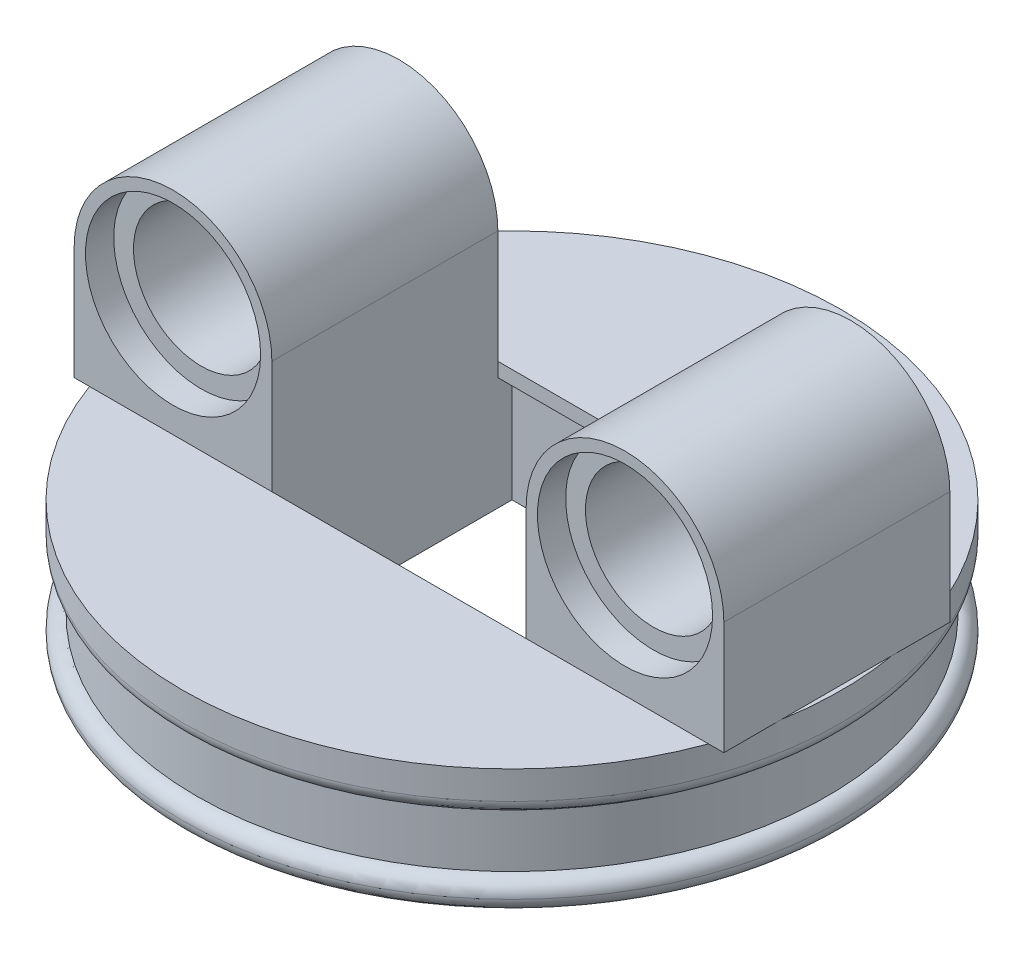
ISO-10303-21;
HEADER;
FILE_DESCRIPTION(('STEP AP214'),'2;1');
FILE_NAME('part.step','',(''),(''),'','','');
FILE_SCHEMA(('AUTOMOTIVE_DESIGN { 1 0 10303 214 1 1 1 1 }'));
ENDSEC;
DATA;
#1=APPLICATION_CONTEXT('core data for automotive mechanical design processes');
#2=APPLICATION_PROTOCOL_DEFINITION('international standard','automotive_design',2000,#1);
#3=PRODUCT_CONTEXT('',#1,'mechanical');
#4=PRODUCT('Part','Part','',(#3));
#5=PRODUCT_RELATED_PRODUCT_CATEGORY('part','',(#4));
#6=PRODUCT_DEFINITION_FORMATION('','',#4);
#7=PRODUCT_DEFINITION_CONTEXT('part definition',#1,'design');
#8=PRODUCT_DEFINITION('design','',#6,#7);
#9=PRODUCT_DEFINITION_SHAPE('','',#8);
#10=(LENGTH_UNIT() NAMED_UNIT(*) SI_UNIT(.MILLI.,.METRE.));
#11=(NAMED_UNIT(*) PLANE_ANGLE_UNIT() SI_UNIT($,.RADIAN.));
#12=(NAMED_UNIT(*) SI_UNIT($,.STERADIAN.) SOLID_ANGLE_UNIT());
#13=UNCERTAINTY_MEASURE_WITH_UNIT(LENGTH_MEASURE(1.E-05),#10,'distance_accuracy_value','');
#14=(GEOMETRIC_REPRESENTATION_CONTEXT(3) GLOBAL_UNCERTAINTY_ASSIGNED_CONTEXT((#13)) GLOBAL_UNIT_ASSIGNED_CONTEXT((#10,
#11,#12)) REPRESENTATION_CONTEXT('',''));
#15=CARTESIAN_POINT('',(0.,0.,0.));
#16=DIRECTION('',(0.,0.,1.));
#17=DIRECTION('',(1.,0.,0.));
#18=AXIS2_PLACEMENT_3D('',#15,#16,#17);
#19=CARTESIAN_POINT('',(0.,-0.5,0.));
#20=DIRECTION('',(0.,1.,0.));
#21=DIRECTION('',(0.,0.,1.));
#22=AXIS2_PLACEMENT_3D('',#19,#20,#21);
#23=PLANE('',#22);
#24=CARTESIAN_POINT('',(0.,-0.5,0.));
#25=DIRECTION('',(0.,-1.,0.));
#26=DIRECTION('',(0.,0.,-1.));
#27=AXIS2_PLACEMENT_3D('',#24,#25,#26);
#28=CIRCLE('',#27,10.665);
#29=CARTESIAN_POINT('',(0.,-0.5,-10.665));
#30=VERTEX_POINT('',#29);
#31=EDGE_CURVE('E284',#30,#30,#28,.T.);
#32=ORIENTED_EDGE('',*,*,#31,.T.);
#33=EDGE_LOOP('',(#32));
#34=FACE_BOUND('',#33,.T.);
#35=DIRECTION('',(-1.,0.,0.));
#36=VECTOR('',#35,1.);
#37=CARTESIAN_POINT('',(5.,-0.5,5.));
#38=LINE('',#37,#36);
#39=CARTESIAN_POINT('',(5.,-0.5,5.));
#40=VERTEX_POINT('',#39);
#41=CARTESIAN_POINT('',(-5.,-0.5,5.));
#42=VERTEX_POINT('',#41);
#43=EDGE_CURVE('E205',#40,#42,#38,.T.);
#44=ORIENTED_EDGE('',*,*,#43,.F.);
#45=DIRECTION('',(0.,0.,1.));
#46=VECTOR('',#45,1.);
#47=CARTESIAN_POINT('',(5.,-0.5,-5.));
#48=LINE('',#47,#46);
#49=CARTESIAN_POINT('',(5.,-0.5,-5.));
#50=VERTEX_POINT('',#49);
#51=EDGE_CURVE('E234',#50,#40,#48,.T.);
#52=ORIENTED_EDGE('',*,*,#51,.F.);
#53=DIRECTION('',(1.,0.,0.));
#54=VECTOR('',#53,1.);
#55=CARTESIAN_POINT('',(-5.,-0.5,-5.));
#56=LINE('',#55,#54);
#57=CARTESIAN_POINT('',(-5.,-0.5,-5.));
#58=VERTEX_POINT('',#57);
#59=EDGE_CURVE('E58',#58,#50,#56,.T.);
#60=ORIENTED_EDGE('',*,*,#59,.F.);
#61=DIRECTION('',(0.,0.,-1.));
#62=VECTOR('',#61,1.);
#63=CARTESIAN_POINT('',(-5.,-0.5,5.));
#64=LINE('',#63,#62);
#65=EDGE_CURVE('E53',#42,#58,#64,.T.);
#66=ORIENTED_EDGE('',*,*,#65,.F.);
#67=EDGE_LOOP('',(#44,#52,#60,#66));
#68=FACE_BOUND('',#67,.T.);
#69=ADVANCED_FACE('F38',(#34,#68),#23,.F.);
#70=DIRECTION('',(1.,0.,0.));
#71=VECTOR('',#70,1.);
#72=CARTESIAN_POINT('',(4.5,-0.5,4.));
#73=LINE('',#72,#71);
#74=CARTESIAN_POINT('',(-4.5,-0.5,4.));
#75=VERTEX_POINT('',#74);
#76=CARTESIAN_POINT('',(4.5,-0.5,4.));
#77=VERTEX_POINT('',#76);
#78=EDGE_CURVE('E261',#75,#77,#73,.T.);
#79=ORIENTED_EDGE('',*,*,#78,.T.);
#80=DIRECTION('',(0.,0.,1.));
#81=VECTOR('',#80,1.);
#82=CARTESIAN_POINT('',(4.5,-0.5,-4.5));
#83=LINE('',#82,#81);
#84=CARTESIAN_POINT('',(4.5,-0.5,4.5));
#85=VERTEX_POINT('',#84);
#86=EDGE_CURVE('E219',#77,#85,#83,.T.);
#87=ORIENTED_EDGE('',*,*,#86,.T.);
#88=DIRECTION('',(-1.,0.,0.));
#89=VECTOR('',#88,1.);
#90=CARTESIAN_POINT('',(-4.5,-0.5,4.5));
#91=LINE('',#90,#89);
#92=CARTESIAN_POINT('',(-4.5,-0.5,4.5));
#93=VERTEX_POINT('',#92);
#94=EDGE_CURVE('E204',#85,#93,#91,.T.);
#95=ORIENTED_EDGE('',*,*,#94,.T.);
#96=DIRECTION('',(0.,0.,-1.));
#97=VECTOR('',#96,1.);
#98=CARTESIAN_POINT('',(-4.5,-0.5,-4.5));
#99=LINE('',#98,#97);
#100=EDGE_CURVE('E222',#93,#75,#99,.T.);
#101=ORIENTED_EDGE('',*,*,#100,.T.);
#102=EDGE_LOOP('',(#79,#87,#95,#101));
#103=FACE_BOUND('',#102,.T.);
#104=ADVANCED_FACE('F418',(#103),#23,.F.);
#105=CARTESIAN_POINT('',(0.,0.,0.));
#106=DIRECTION('',(0.,1.,0.));
#107=DIRECTION('',(0.,0.,1.));
#108=AXIS2_PLACEMENT_3D('',#105,#106,#107);
#109=PLANE('',#108);
#110=DIRECTION('',(-1.,0.,0.));
#111=VECTOR('',#110,1.);
#112=CARTESIAN_POINT('',(-4.5,0.,-4.));
#113=LINE('',#112,#111);
#114=CARTESIAN_POINT('',(4.5,0.,-4.));
#115=VERTEX_POINT('',#114);
#116=CARTESIAN_POINT('',(-4.5,0.,-4.));
#117=VERTEX_POINT('',#116);
#118=EDGE_CURVE('E257',#115,#117,#113,.T.);
#119=ORIENTED_EDGE('',*,*,#118,.F.);
#120=DIRECTION('',(1.,0.,0.));
#121=VECTOR('',#120,1.);
#122=CARTESIAN_POINT('',(4.5,0.,-4.));
#123=LINE('',#122,#121);
#124=CARTESIAN_POINT('',(10.9577472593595,0.,-4.));
#125=VERTEX_POINT('',#124);
#126=EDGE_CURVE('E315',#115,#125,#123,.T.);
#127=ORIENTED_EDGE('',*,*,#126,.T.);
#128=CARTESIAN_POINT('',(0.,0.,0.));
#129=DIRECTION('',(0.,1.,0.));
#130=DIRECTION('',(0.,0.,1.));
#131=AXIS2_PLACEMENT_3D('',#128,#129,#130);
#132=CIRCLE('',#131,11.665);
#133=CARTESIAN_POINT('',(-10.9577472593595,0.,-4.));
#134=VERTEX_POINT('',#133);
#135=EDGE_CURVE('E333',#125,#134,#132,.T.);
#136=ORIENTED_EDGE('',*,*,#135,.T.);
#137=DIRECTION('',(1.,0.,0.));
#138=VECTOR('',#137,1.);
#139=CARTESIAN_POINT('',(-11.5,0.,-4.));
#140=LINE('',#139,#138);
#141=EDGE_CURVE('E377',#134,#117,#140,.T.);
#142=ORIENTED_EDGE('',*,*,#141,.T.);
#143=EDGE_LOOP('',(#119,#127,#136,#142));
#144=FACE_BOUND('',#143,.T.);
#145=ADVANCED_FACE('F425',(#144),#109,.T.);
#146=CARTESIAN_POINT('',(11.5,0.,1.95505115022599));
#147=VERTEX_POINT('',#146);
#148=CARTESIAN_POINT('',(11.5,0.,-1.95505115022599));
#149=VERTEX_POINT('',#148);
#150=EDGE_CURVE('E494',#147,#149,#132,.T.);
#151=ORIENTED_EDGE('',*,*,#150,.T.);
#152=DIRECTION('',(0.,0.,-1.));
#153=VECTOR('',#152,1.);
#154=CARTESIAN_POINT('',(11.5,0.,4.));
#155=LINE('',#154,#153);
#156=EDGE_CURVE('E334',#147,#149,#155,.T.);
#157=ORIENTED_EDGE('',*,*,#156,.F.);
#158=EDGE_LOOP('',(#151,#157));
#159=FACE_BOUND('',#158,.T.);
#160=ADVANCED_FACE('F529',(#159),#109,.T.);
#161=DIRECTION('',(1.,0.,0.));
#162=VECTOR('',#161,1.);
#163=CARTESIAN_POINT('',(4.5,0.,4.));
#164=LINE('',#163,#162);
#165=CARTESIAN_POINT('',(-4.5,0.,4.));
#166=VERTEX_POINT('',#165);
#167=CARTESIAN_POINT('',(4.5,0.,4.));
#168=VERTEX_POINT('',#167);
#169=EDGE_CURVE('E262',#166,#168,#164,.T.);
#170=ORIENTED_EDGE('',*,*,#169,.F.);
#171=DIRECTION('',(1.,0.,0.));
#172=VECTOR('',#171,1.);
#173=CARTESIAN_POINT('',(-11.5,0.,4.));
#174=LINE('',#173,#172);
#175=CARTESIAN_POINT('',(-10.9577472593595,0.,4.));
#176=VERTEX_POINT('',#175);
#177=EDGE_CURVE('E364',#176,#166,#174,.T.);
#178=ORIENTED_EDGE('',*,*,#177,.F.);
#179=CARTESIAN_POINT('',(10.9577472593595,0.,4.));
#180=VERTEX_POINT('',#179);
#181=EDGE_CURVE('E489',#176,#180,#132,.T.);
#182=ORIENTED_EDGE('',*,*,#181,.T.);
#183=DIRECTION('',(1.,0.,0.));
#184=VECTOR('',#183,1.);
#185=CARTESIAN_POINT('',(4.5,0.,4.));
#186=LINE('',#185,#184);
#187=EDGE_CURVE('E303',#168,#180,#186,.T.);
#188=ORIENTED_EDGE('',*,*,#187,.F.);
#189=EDGE_LOOP('',(#170,#178,#182,#188));
#190=FACE_BOUND('',#189,.T.);
#191=ADVANCED_FACE('F468',(#190),#109,.T.);
#192=CARTESIAN_POINT('',(-11.5,0.,4.));
#193=DIRECTION('',(0.,1.,0.));
#194=DIRECTION('',(0.,0.,1.));
#195=AXIS2_PLACEMENT_3D('',#192,#193,#194);
#196=PLANE('',#195);
#197=CARTESIAN_POINT('',(-11.5,0.,-4.));
#198=VERTEX_POINT('',#197);
#199=EDGE_CURVE('E378',#198,#134,#140,.T.);
#200=ORIENTED_EDGE('',*,*,#199,.T.);
#201=CARTESIAN_POINT('',(-11.5,0.,-1.95505115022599));
#202=VERTEX_POINT('',#201);
#203=EDGE_CURVE('E339',#134,#202,#132,.T.);
#204=ORIENTED_EDGE('',*,*,#203,.T.);
#205=DIRECTION('',(0.,0.,-1.));
#206=VECTOR('',#205,1.);
#207=CARTESIAN_POINT('',(-11.5,0.,4.));
#208=LINE('',#207,#206);
#209=EDGE_CURVE('E384',#202,#198,#208,.T.);
#210=ORIENTED_EDGE('',*,*,#209,.T.);
#211=EDGE_LOOP('',(#200,#204,#210));
#212=FACE_BOUND('',#211,.T.);
#213=ADVANCED_FACE('F515',(#212),#196,.F.);
#214=CARTESIAN_POINT('',(-8.,4.,-4.));
#215=DIRECTION('',(0.,0.,1.));
#216=DIRECTION('',(1.,0.,0.));
#217=AXIS2_PLACEMENT_3D('',#214,#215,#216);
#218=CYLINDRICAL_SURFACE('',#217,2.4);
#219=CARTESIAN_POINT('',(-8.,4.,3.));
#220=DIRECTION('',(0.,0.,1.));
#221=DIRECTION('',(1.,0.,0.));
#222=AXIS2_PLACEMENT_3D('',#219,#220,#221);
#223=CIRCLE('',#222,2.4);
#224=CARTESIAN_POINT('',(-5.6,4.,3.));
#225=VERTEX_POINT('',#224);
#226=EDGE_CURVE('E354',#225,#225,#223,.F.);
#227=ORIENTED_EDGE('',*,*,#226,.F.);
#228=EDGE_LOOP('',(#227));
#229=FACE_BOUND('',#228,.T.);
#230=CARTESIAN_POINT('',(-8.,4.,-3.));
#231=DIRECTION('',(0.,0.,-1.));
#232=DIRECTION('',(-1.,0.,0.));
#233=AXIS2_PLACEMENT_3D('',#230,#231,#232);
#234=CIRCLE('',#233,2.4);
#235=CARTESIAN_POINT('',(-10.4,4.,-3.));
#236=VERTEX_POINT('',#235);
#237=EDGE_CURVE('E348',#236,#236,#234,.F.);
#238=ORIENTED_EDGE('',*,*,#237,.F.);
#239=EDGE_LOOP('',(#238));
#240=FACE_BOUND('',#239,.T.);
#241=ADVANCED_FACE('F535',(#229,#240),#218,.F.);
#242=CARTESIAN_POINT('',(-8.,4.,4.));
#243=DIRECTION('',(0.,0.,-1.));
#244=DIRECTION('',(-1.,0.,0.));
#245=AXIS2_PLACEMENT_3D('',#242,#243,#244);
#246=CYLINDRICAL_SURFACE('',#245,3.5);
#247=CARTESIAN_POINT('',(-8.,4.,-4.));
#248=DIRECTION('',(0.,0.,1.));
#249=DIRECTION('',(-1.,0.,0.));
#250=AXIS2_PLACEMENT_3D('',#247,#248,#249);
#251=CIRCLE('',#250,3.5);
#252=CARTESIAN_POINT('',(-4.5,4.,-4.));
#253=VERTEX_POINT('',#252);
#254=CARTESIAN_POINT('',(-11.5,4.,-4.));
#255=VERTEX_POINT('',#254);
#256=EDGE_CURVE('E371',#253,#255,#251,.T.);
#257=ORIENTED_EDGE('',*,*,#256,.T.);
#258=DIRECTION('',(0.,0.,-1.));
#259=VECTOR('',#258,1.);
#260=CARTESIAN_POINT('',(-11.5,4.,4.));
#261=LINE('',#260,#259);
#262=CARTESIAN_POINT('',(-11.5,4.,4.));
#263=VERTEX_POINT('',#262);
#264=EDGE_CURVE('E388',#263,#255,#261,.T.);
#265=ORIENTED_EDGE('',*,*,#264,.F.);
#266=CARTESIAN_POINT('',(-8.,4.,4.));
#267=DIRECTION('',(0.,0.,1.));
#268=DIRECTION('',(-1.,0.,0.));
#269=AXIS2_PLACEMENT_3D('',#266,#267,#268);
#270=CIRCLE('',#269,3.5);
#271=CARTESIAN_POINT('',(-4.5,4.,4.));
#272=VERTEX_POINT('',#271);
#273=EDGE_CURVE('E358',#272,#263,#270,.T.);
#274=ORIENTED_EDGE('',*,*,#273,.F.);
#275=DIRECTION('',(0.,0.,-1.));
#276=VECTOR('',#275,1.);
#277=CARTESIAN_POINT('',(-4.5,4.,4.));
#278=LINE('',#277,#276);
#279=EDGE_CURVE('E370',#272,#253,#278,.T.);
#280=ORIENTED_EDGE('',*,*,#279,.T.);
#281=EDGE_LOOP('',(#257,#265,#274,#280));
#282=FACE_BOUND('',#281,.T.);
#283=ADVANCED_FACE('F478',(#282),#246,.T.);
#284=CARTESIAN_POINT('',(-11.5,4.,4.));
#285=DIRECTION('',(1.,0.,0.));
#286=DIRECTION('',(0.,0.,-1.));
#287=AXIS2_PLACEMENT_3D('',#284,#285,#286);
#288=PLANE('',#287);
#289=DIRECTION('',(0.,-1.,0.));
#290=VECTOR('',#289,1.);
#291=CARTESIAN_POINT('',(-11.5,4.,-4.));
#292=LINE('',#291,#290);
#293=EDGE_CURVE('E374',#255,#198,#292,.T.);
#294=ORIENTED_EDGE('',*,*,#293,.T.);
#295=ORIENTED_EDGE('',*,*,#209,.F.);
#296=CARTESIAN_POINT('',(-11.5,0.,1.95505115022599));
#297=VERTEX_POINT('',#296);
#298=EDGE_CURVE('E389',#297,#202,#208,.T.);
#299=ORIENTED_EDGE('',*,*,#298,.F.);
#300=CARTESIAN_POINT('',(-11.5,0.,4.));
#301=VERTEX_POINT('',#300);
#302=EDGE_CURVE('E385',#301,#297,#208,.T.);
#303=ORIENTED_EDGE('',*,*,#302,.F.);
#304=DIRECTION('',(0.,-1.,0.));
#305=VECTOR('',#304,1.);
#306=CARTESIAN_POINT('',(-11.5,4.,4.));
#307=LINE('',#306,#305);
#308=EDGE_CURVE('E361',#263,#301,#307,.T.);
#309=ORIENTED_EDGE('',*,*,#308,.F.);
#310=ORIENTED_EDGE('',*,*,#264,.T.);
#311=EDGE_LOOP('',(#294,#295,#299,#303,#309,#310));
#312=FACE_BOUND('',#311,.T.);
#313=ADVANCED_FACE('F482',(#312),#288,.F.);
#314=ORIENTED_EDGE('',*,*,#302,.T.);
#315=EDGE_CURVE('E344',#297,#176,#132,.T.);
#316=ORIENTED_EDGE('',*,*,#315,.T.);
#317=EDGE_CURVE('E365',#301,#176,#174,.T.);
#318=ORIENTED_EDGE('',*,*,#317,.F.);
#319=EDGE_LOOP('',(#314,#316,#318));
#320=FACE_BOUND('',#319,.T.);
#321=ADVANCED_FACE('F485',(#320),#196,.F.);
#322=CARTESIAN_POINT('',(-4.5,4.,4.));
#323=DIRECTION('',(-1.,0.,0.));
#324=DIRECTION('',(0.,0.,1.));
#325=AXIS2_PLACEMENT_3D('',#322,#323,#324);
#326=PLANE('',#325);
#327=DIRECTION('',(0.,1.,0.));
#328=VECTOR('',#327,1.);
#329=CARTESIAN_POINT('',(-4.5,4.,-4.));
#330=LINE('',#329,#328);
#331=EDGE_CURVE('E362',#117,#253,#330,.T.);
#332=ORIENTED_EDGE('',*,*,#331,.T.);
#333=ORIENTED_EDGE('',*,*,#279,.F.);
#334=DIRECTION('',(0.,1.,0.));
#335=VECTOR('',#334,1.);
#336=CARTESIAN_POINT('',(-4.5,4.,4.));
#337=LINE('',#336,#335);
#338=EDGE_CURVE('E368',#166,#272,#337,.T.);
#339=ORIENTED_EDGE('',*,*,#338,.F.);
#340=DIRECTION('',(0.,1.,0.));
#341=VECTOR('',#340,1.);
#342=CARTESIAN_POINT('',(-4.5,-0.5,4.));
#343=LINE('',#342,#341);
#344=EDGE_CURVE('E275',#75,#166,#343,.T.);
#345=ORIENTED_EDGE('',*,*,#344,.F.);
#346=ORIENTED_EDGE('',*,*,#100,.F.);
#347=DIRECTION('',(0.,1.,0.));
#348=VECTOR('',#347,1.);
#349=CARTESIAN_POINT('',(-4.5,-4.5,4.5));
#350=LINE('',#349,#348);
#351=CARTESIAN_POINT('',(-4.5,-4.5,4.5));
#352=VERTEX_POINT('',#351);
#353=EDGE_CURVE('E206',#352,#93,#350,.T.);
#354=ORIENTED_EDGE('',*,*,#353,.F.);
#355=DIRECTION('',(0.,0.,-1.));
#356=VECTOR('',#355,1.);
#357=CARTESIAN_POINT('',(-4.5,-4.5,-4.5));
#358=LINE('',#357,#356);
#359=CARTESIAN_POINT('',(-4.5,-4.5,-4.5));
#360=VERTEX_POINT('',#359);
#361=EDGE_CURVE('E211',#352,#360,#358,.T.);
#362=ORIENTED_EDGE('',*,*,#361,.T.);
#363=DIRECTION('',(0.,1.,0.));
#364=VECTOR('',#363,1.);
#365=CARTESIAN_POINT('',(-4.5,-4.5,-4.5));
#366=LINE('',#365,#364);
#367=CARTESIAN_POINT('',(-4.5,-0.5,-4.5));
#368=VERTEX_POINT('',#367);
#369=EDGE_CURVE('E227',#360,#368,#366,.T.);
#370=ORIENTED_EDGE('',*,*,#369,.T.);
#371=CARTESIAN_POINT('',(-4.5,-0.5,-4.));
#372=VERTEX_POINT('',#371);
#373=EDGE_CURVE('E221',#372,#368,#99,.T.);
#374=ORIENTED_EDGE('',*,*,#373,.F.);
#375=DIRECTION('',(0.,1.,0.));
#376=VECTOR('',#375,1.);
#377=CARTESIAN_POINT('',(-4.5,-0.5,-4.));
#378=LINE('',#377,#376);
#379=EDGE_CURVE('E265',#372,#117,#378,.T.);
#380=ORIENTED_EDGE('',*,*,#379,.T.);
#381=EDGE_LOOP('',(#332,#333,#339,#345,#346,#354,#362,#370,#374,#380));
#382=FACE_BOUND('',#381,.T.);
#383=ADVANCED_FACE('F452',(#382),#326,.F.);
#384=CARTESIAN_POINT('',(-8.,4.,4.));
#385=DIRECTION('',(0.,0.,-1.));
#386=DIRECTION('',(-1.,0.,0.));
#387=AXIS2_PLACEMENT_3D('',#384,#385,#386);
#388=PLANE('',#387);
#389=CARTESIAN_POINT('',(-8.,4.,4.));
#390=DIRECTION('',(0.,0.,1.));
#391=DIRECTION('',(1.,0.,0.));
#392=AXIS2_PLACEMENT_3D('',#389,#390,#391);
#393=CIRCLE('',#392,3.1);
#394=CARTESIAN_POINT('',(-4.9,4.,4.));
#395=VERTEX_POINT('',#394);
#396=EDGE_CURVE('E355',#395,#395,#393,.T.);
#397=ORIENTED_EDGE('',*,*,#396,.F.);
#398=EDGE_LOOP('',(#397));
#399=FACE_BOUND('',#398,.T.);
#400=ORIENTED_EDGE('',*,*,#273,.T.);
#401=ORIENTED_EDGE('',*,*,#308,.T.);
#402=ORIENTED_EDGE('',*,*,#317,.T.);
#403=ORIENTED_EDGE('',*,*,#177,.T.);
#404=ORIENTED_EDGE('',*,*,#338,.T.);
#405=EDGE_LOOP('',(#400,#401,#402,#403,#404));
#406=FACE_BOUND('',#405,.T.);
#407=ADVANCED_FACE('F472',(#399,#406),#388,.F.);
#408=CARTESIAN_POINT('',(-8.,4.,-4.));
#409=DIRECTION('',(0.,0.,-1.));
#410=DIRECTION('',(-1.,0.,0.));
#411=AXIS2_PLACEMENT_3D('',#408,#409,#410);
#412=PLANE('',#411);
#413=CARTESIAN_POINT('',(-8.,4.,-4.));
#414=DIRECTION('',(0.,0.,1.));
#415=DIRECTION('',(1.,0.,0.));
#416=AXIS2_PLACEMENT_3D('',#413,#414,#415);
#417=CIRCLE('',#416,3.1);
#418=CARTESIAN_POINT('',(-4.9,4.,-4.));
#419=VERTEX_POINT('',#418);
#420=EDGE_CURVE('E342',#419,#419,#417,.T.);
#421=ORIENTED_EDGE('',*,*,#420,.T.);
#422=EDGE_LOOP('',(#421));
#423=FACE_BOUND('',#422,.T.);
#424=ORIENTED_EDGE('',*,*,#256,.F.);
#425=ORIENTED_EDGE('',*,*,#331,.F.);
#426=ORIENTED_EDGE('',*,*,#141,.F.);
#427=ORIENTED_EDGE('',*,*,#199,.F.);
#428=ORIENTED_EDGE('',*,*,#293,.F.);
#429=EDGE_LOOP('',(#424,#425,#426,#427,#428));
#430=FACE_BOUND('',#429,.T.);
#431=ADVANCED_FACE('F514',(#423,#430),#412,.T.);
#432=CARTESIAN_POINT('',(-8.,4.,3.));
#433=DIRECTION('',(0.,0.,1.));
#434=DIRECTION('',(1.,0.,0.));
#435=AXIS2_PLACEMENT_3D('',#432,#433,#434);
#436=PLANE('',#435);
#437=CARTESIAN_POINT('',(-8.,4.,3.));
#438=DIRECTION('',(0.,0.,1.));
#439=DIRECTION('',(1.,0.,0.));
#440=AXIS2_PLACEMENT_3D('',#437,#438,#439);
#441=CIRCLE('',#440,3.1);
#442=CARTESIAN_POINT('',(-4.9,4.,3.));
#443=VERTEX_POINT('',#442);
#444=EDGE_CURVE('E351',#443,#443,#441,.T.);
#445=ORIENTED_EDGE('',*,*,#444,.T.);
#446=EDGE_LOOP('',(#445));
#447=FACE_BOUND('',#446,.T.);
#448=ORIENTED_EDGE('',*,*,#226,.T.);
#449=EDGE_LOOP('',(#448));
#450=FACE_BOUND('',#449,.T.);
#451=ADVANCED_FACE('F815',(#447,#450),#436,.T.);
#452=CARTESIAN_POINT('',(-8.,4.,3.));
#453=DIRECTION('',(0.,0.,1.));
#454=DIRECTION('',(1.,0.,0.));
#455=AXIS2_PLACEMENT_3D('',#452,#453,#454);
#456=CYLINDRICAL_SURFACE('',#455,3.1);
#457=ORIENTED_EDGE('',*,*,#444,.F.);
#458=EDGE_LOOP('',(#457));
#459=FACE_BOUND('',#458,.T.);
#460=ORIENTED_EDGE('',*,*,#396,.T.);
#461=EDGE_LOOP('',(#460));
#462=FACE_BOUND('',#461,.T.);
#463=ADVANCED_FACE('F874',(#459,#462),#456,.F.);
#464=CARTESIAN_POINT('',(-8.,4.,-3.));
#465=DIRECTION('',(0.,0.,-1.));
#466=DIRECTION('',(1.,0.,0.));
#467=AXIS2_PLACEMENT_3D('',#464,#465,#466);
#468=PLANE('',#467);
#469=CARTESIAN_POINT('',(-8.,4.,-3.));
#470=DIRECTION('',(0.,0.,1.));
#471=DIRECTION('',(1.,0.,0.));
#472=AXIS2_PLACEMENT_3D('',#469,#470,#471);
#473=CIRCLE('',#472,3.1);
#474=CARTESIAN_POINT('',(-4.9,4.,-3.));
#475=VERTEX_POINT('',#474);
#476=EDGE_CURVE('E345',#475,#475,#473,.T.);
#477=ORIENTED_EDGE('',*,*,#476,.F.);
#478=EDGE_LOOP('',(#477));
#479=FACE_BOUND('',#478,.T.);
#480=ORIENTED_EDGE('',*,*,#237,.T.);
#481=EDGE_LOOP('',(#480));
#482=FACE_BOUND('',#481,.T.);
#483=ADVANCED_FACE('F865',(#479,#482),#468,.T.);
#484=CARTESIAN_POINT('',(-8.,4.,-3.));
#485=DIRECTION('',(0.,0.,-1.));
#486=DIRECTION('',(-1.,0.,0.));
#487=AXIS2_PLACEMENT_3D('',#484,#485,#486);
#488=CYLINDRICAL_SURFACE('',#487,3.1);
#489=ORIENTED_EDGE('',*,*,#476,.T.);
#490=EDGE_LOOP('',(#489));
#491=FACE_BOUND('',#490,.T.);
#492=ORIENTED_EDGE('',*,*,#420,.F.);
#493=EDGE_LOOP('',(#492));
#494=FACE_BOUND('',#493,.T.);
#495=ADVANCED_FACE('F525',(#491,#494),#488,.F.);
#496=CARTESIAN_POINT('',(0.,-0.5,0.));
#497=DIRECTION('',(0.,1.,0.));
#498=DIRECTION('',(0.,0.,1.));
#499=AXIS2_PLACEMENT_3D('',#496,#497,#498);
#500=CYLINDRICAL_SURFACE('',#499,11.665);
#501=CARTESIAN_POINT('',(0.,-1.,0.));
#502=DIRECTION('',(0.,-1.,0.));
#503=DIRECTION('',(0.,0.,-1.));
#504=AXIS2_PLACEMENT_3D('',#501,#502,#503);
#505=CIRCLE('',#504,11.665);
#506=CARTESIAN_POINT('',(0.,-1.,-11.665));
#507=VERTEX_POINT('',#506);
#508=EDGE_CURVE('E11',#507,#507,#505,.F.);
#509=ORIENTED_EDGE('',*,*,#508,.T.);
#510=EDGE_LOOP('',(#509));
#511=FACE_BOUND('',#510,.T.);
#512=ORIENTED_EDGE('',*,*,#203,.F.);
#513=ORIENTED_EDGE('',*,*,#135,.F.);
#514=EDGE_CURVE('E498',#149,#125,#132,.T.);
#515=ORIENTED_EDGE('',*,*,#514,.F.);
#516=ORIENTED_EDGE('',*,*,#150,.F.);
#517=EDGE_CURVE('E491',#180,#147,#132,.T.);
#518=ORIENTED_EDGE('',*,*,#517,.F.);
#519=ORIENTED_EDGE('',*,*,#181,.F.);
#520=ORIENTED_EDGE('',*,*,#315,.F.);
#521=EDGE_CURVE('E343',#202,#297,#132,.T.);
#522=ORIENTED_EDGE('',*,*,#521,.F.);
#523=EDGE_LOOP('',(#512,#513,#515,#516,#518,#519,#520,#522));
#524=FACE_BOUND('',#523,.T.);
#525=ADVANCED_FACE('F510',(#511,#524),#500,.T.);
#526=ORIENTED_EDGE('',*,*,#521,.T.);
#527=ORIENTED_EDGE('',*,*,#298,.T.);
#528=EDGE_LOOP('',(#526,#527));
#529=FACE_BOUND('',#528,.T.);
#530=ADVANCED_FACE('F516',(#529),#109,.T.);
#531=CARTESIAN_POINT('',(4.5,0.,4.));
#532=DIRECTION('',(0.,1.,0.));
#533=DIRECTION('',(0.,0.,1.));
#534=AXIS2_PLACEMENT_3D('',#531,#532,#533);
#535=PLANE('',#534);
#536=ORIENTED_EDGE('',*,*,#514,.T.);
#537=CARTESIAN_POINT('',(11.5,0.,-4.));
#538=VERTEX_POINT('',#537);
#539=EDGE_CURVE('E318',#125,#538,#123,.T.);
#540=ORIENTED_EDGE('',*,*,#539,.T.);
#541=EDGE_CURVE('E329',#149,#538,#155,.T.);
#542=ORIENTED_EDGE('',*,*,#541,.F.);
#543=EDGE_LOOP('',(#536,#540,#542));
#544=FACE_BOUND('',#543,.T.);
#545=ADVANCED_FACE('F518',(#544),#535,.F.);
#546=CARTESIAN_POINT('',(8.,4.,-4.));
#547=DIRECTION('',(0.,0.,1.));
#548=DIRECTION('',(1.,0.,0.));
#549=AXIS2_PLACEMENT_3D('',#546,#547,#548);
#550=CYLINDRICAL_SURFACE('',#549,2.4);
#551=CARTESIAN_POINT('',(8.,4.,3.));
#552=DIRECTION('',(0.,0.,1.));
#553=DIRECTION('',(1.,0.,0.));
#554=AXIS2_PLACEMENT_3D('',#551,#552,#553);
#555=CIRCLE('',#554,2.4);
#556=CARTESIAN_POINT('',(10.4,4.,3.));
#557=VERTEX_POINT('',#556);
#558=EDGE_CURVE('E299',#557,#557,#555,.F.);
#559=ORIENTED_EDGE('',*,*,#558,.F.);
#560=EDGE_LOOP('',(#559));
#561=FACE_BOUND('',#560,.T.);
#562=CARTESIAN_POINT('',(8.,4.,-3.));
#563=DIRECTION('',(0.,0.,-1.));
#564=DIRECTION('',(-1.,0.,0.));
#565=AXIS2_PLACEMENT_3D('',#562,#563,#564);
#566=CIRCLE('',#565,2.4);
#567=CARTESIAN_POINT('',(5.6,4.,-3.));
#568=VERTEX_POINT('',#567);
#569=EDGE_CURVE('E293',#568,#568,#566,.F.);
#570=ORIENTED_EDGE('',*,*,#569,.F.);
#571=EDGE_LOOP('',(#570));
#572=FACE_BOUND('',#571,.T.);
#573=ADVANCED_FACE('F523',(#561,#572),#550,.F.);
#574=ORIENTED_EDGE('',*,*,#517,.T.);
#575=CARTESIAN_POINT('',(11.5,0.,4.));
#576=VERTEX_POINT('',#575);
#577=EDGE_CURVE('E330',#576,#147,#155,.T.);
#578=ORIENTED_EDGE('',*,*,#577,.F.);
#579=EDGE_CURVE('E307',#180,#576,#186,.T.);
#580=ORIENTED_EDGE('',*,*,#579,.F.);
#581=EDGE_LOOP('',(#574,#578,#580));
#582=FACE_BOUND('',#581,.T.);
#583=ADVANCED_FACE('F524',(#582),#535,.F.);
#584=CARTESIAN_POINT('',(11.5,4.,4.));
#585=DIRECTION('',(-1.,0.,0.));
#586=DIRECTION('',(0.,0.,1.));
#587=AXIS2_PLACEMENT_3D('',#584,#585,#586);
#588=PLANE('',#587);
#589=DIRECTION('',(0.,1.,0.));
#590=VECTOR('',#589,1.);
#591=CARTESIAN_POINT('',(11.5,4.,-4.));
#592=LINE('',#591,#590);
#593=CARTESIAN_POINT('',(11.5,4.,-4.));
#594=VERTEX_POINT('',#593);
#595=EDGE_CURVE('E317',#538,#594,#592,.T.);
#596=ORIENTED_EDGE('',*,*,#595,.T.);
#597=DIRECTION('',(0.,0.,-1.));
#598=VECTOR('',#597,1.);
#599=CARTESIAN_POINT('',(11.5,4.,4.));
#600=LINE('',#599,#598);
#601=CARTESIAN_POINT('',(11.5,4.,4.));
#602=VERTEX_POINT('',#601);
#603=EDGE_CURVE('E326',#602,#594,#600,.T.);
#604=ORIENTED_EDGE('',*,*,#603,.F.);
#605=DIRECTION('',(0.,1.,0.));
#606=VECTOR('',#605,1.);
#607=CARTESIAN_POINT('',(11.5,4.,4.));
#608=LINE('',#607,#606);
#609=EDGE_CURVE('E306',#576,#602,#608,.T.);
#610=ORIENTED_EDGE('',*,*,#609,.F.);
#611=ORIENTED_EDGE('',*,*,#577,.T.);
#612=ORIENTED_EDGE('',*,*,#156,.T.);
#613=ORIENTED_EDGE('',*,*,#541,.T.);
#614=EDGE_LOOP('',(#596,#604,#610,#611,#612,#613));
#615=FACE_BOUND('',#614,.T.);
#616=ADVANCED_FACE('F698',(#615),#588,.F.);
#617=CARTESIAN_POINT('',(8.,4.,4.));
#618=DIRECTION('',(0.,0.,-1.));
#619=DIRECTION('',(-1.,0.,0.));
#620=AXIS2_PLACEMENT_3D('',#617,#618,#619);
#621=CYLINDRICAL_SURFACE('',#620,3.5);
#622=CARTESIAN_POINT('',(8.,4.,-4.));
#623=DIRECTION('',(0.,0.,1.));
#624=DIRECTION('',(-1.,0.,0.));
#625=AXIS2_PLACEMENT_3D('',#622,#623,#624);
#626=CIRCLE('',#625,3.5);
#627=CARTESIAN_POINT('',(4.5,4.,-4.));
#628=VERTEX_POINT('',#627);
#629=EDGE_CURVE('E320',#594,#628,#626,.T.);
#630=ORIENTED_EDGE('',*,*,#629,.T.);
#631=DIRECTION('',(0.,0.,-1.));
#632=VECTOR('',#631,1.);
#633=CARTESIAN_POINT('',(4.5,4.,4.));
#634=LINE('',#633,#632);
#635=CARTESIAN_POINT('',(4.5,4.,4.));
#636=VERTEX_POINT('',#635);
#637=EDGE_CURVE('E314',#636,#628,#634,.T.);
#638=ORIENTED_EDGE('',*,*,#637,.F.);
#639=CARTESIAN_POINT('',(8.,4.,4.));
#640=DIRECTION('',(0.,0.,1.));
#641=DIRECTION('',(-1.,0.,0.));
#642=AXIS2_PLACEMENT_3D('',#639,#640,#641);
#643=CIRCLE('',#642,3.5);
#644=EDGE_CURVE('E309',#602,#636,#643,.T.);
#645=ORIENTED_EDGE('',*,*,#644,.F.);
#646=ORIENTED_EDGE('',*,*,#603,.T.);
#647=EDGE_LOOP('',(#630,#638,#645,#646));
#648=FACE_BOUND('',#647,.T.);
#649=ADVANCED_FACE('F574',(#648),#621,.T.);
#650=CARTESIAN_POINT('',(4.5,4.,4.));
#651=DIRECTION('',(1.,0.,0.));
#652=DIRECTION('',(0.,0.,-1.));
#653=AXIS2_PLACEMENT_3D('',#650,#651,#652);
#654=PLANE('',#653);
#655=DIRECTION('',(0.,-1.,0.));
#656=VECTOR('',#655,1.);
#657=CARTESIAN_POINT('',(4.5,4.,-4.));
#658=LINE('',#657,#656);
#659=EDGE_CURVE('E322',#628,#115,#658,.T.);
#660=ORIENTED_EDGE('',*,*,#659,.T.);
#661=DIRECTION('',(0.,1.,0.));
#662=VECTOR('',#661,1.);
#663=CARTESIAN_POINT('',(4.5,-0.5,-4.));
#664=LINE('',#663,#662);
#665=CARTESIAN_POINT('',(4.5,-0.5,-4.));
#666=VERTEX_POINT('',#665);
#667=EDGE_CURVE('E269',#666,#115,#664,.T.);
#668=ORIENTED_EDGE('',*,*,#667,.F.);
#669=CARTESIAN_POINT('',(4.5,-0.5,-4.5));
#670=VERTEX_POINT('',#669);
#671=EDGE_CURVE('E217',#670,#666,#83,.T.);
#672=ORIENTED_EDGE('',*,*,#671,.F.);
#673=DIRECTION('',(0.,1.,0.));
#674=VECTOR('',#673,1.);
#675=CARTESIAN_POINT('',(4.5,-4.5,-4.5));
#676=LINE('',#675,#674);
#677=CARTESIAN_POINT('',(4.5,-4.5,-4.5));
#678=VERTEX_POINT('',#677);
#679=EDGE_CURVE('E193',#678,#670,#676,.T.);
#680=ORIENTED_EDGE('',*,*,#679,.F.);
#681=DIRECTION('',(0.,0.,1.));
#682=VECTOR('',#681,1.);
#683=CARTESIAN_POINT('',(4.5,-4.5,-4.5));
#684=LINE('',#683,#682);
#685=CARTESIAN_POINT('',(4.5,-4.5,4.5));
#686=VERTEX_POINT('',#685);
#687=EDGE_CURVE('E186',#678,#686,#684,.T.);
#688=ORIENTED_EDGE('',*,*,#687,.T.);
#689=DIRECTION('',(0.,1.,0.));
#690=VECTOR('',#689,1.);
#691=CARTESIAN_POINT('',(4.5,-4.5,4.5));
#692=LINE('',#691,#690);
#693=EDGE_CURVE('E190',#686,#85,#692,.T.);
#694=ORIENTED_EDGE('',*,*,#693,.T.);
#695=ORIENTED_EDGE('',*,*,#86,.F.);
#696=DIRECTION('',(0.,1.,0.));
#697=VECTOR('',#696,1.);
#698=CARTESIAN_POINT('',(4.5,-0.5,4.));
#699=LINE('',#698,#697);
#700=EDGE_CURVE('E272',#77,#168,#699,.T.);
#701=ORIENTED_EDGE('',*,*,#700,.T.);
#702=DIRECTION('',(0.,-1.,0.));
#703=VECTOR('',#702,1.);
#704=CARTESIAN_POINT('',(4.5,4.,4.));
#705=LINE('',#704,#703);
#706=EDGE_CURVE('E311',#636,#168,#705,.T.);
#707=ORIENTED_EDGE('',*,*,#706,.F.);
#708=ORIENTED_EDGE('',*,*,#637,.T.);
#709=EDGE_LOOP('',(#660,#668,#672,#680,#688,#694,#695,#701,#707,#708));
#710=FACE_BOUND('',#709,.T.);
#711=ADVANCED_FACE('F189',(#710),#654,.F.);
#712=CARTESIAN_POINT('',(8.,4.,4.));
#713=DIRECTION('',(0.,0.,-1.));
#714=DIRECTION('',(-1.,0.,0.));
#715=AXIS2_PLACEMENT_3D('',#712,#713,#714);
#716=PLANE('',#715);
#717=CARTESIAN_POINT('',(8.,4.,4.));
#718=DIRECTION('',(0.,0.,1.));
#719=DIRECTION('',(1.,0.,0.));
#720=AXIS2_PLACEMENT_3D('',#717,#718,#719);
#721=CIRCLE('',#720,3.1);
#722=CARTESIAN_POINT('',(11.1,4.,4.));
#723=VERTEX_POINT('',#722);
#724=EDGE_CURVE('E300',#723,#723,#721,.T.);
#725=ORIENTED_EDGE('',*,*,#724,.F.);
#726=EDGE_LOOP('',(#725));
#727=FACE_BOUND('',#726,.T.);
#728=ORIENTED_EDGE('',*,*,#187,.T.);
#729=ORIENTED_EDGE('',*,*,#579,.T.);
#730=ORIENTED_EDGE('',*,*,#609,.T.);
#731=ORIENTED_EDGE('',*,*,#644,.T.);
#732=ORIENTED_EDGE('',*,*,#706,.T.);
#733=EDGE_LOOP('',(#728,#729,#730,#731,#732));
#734=FACE_BOUND('',#733,.T.);
#735=ADVANCED_FACE('F573',(#727,#734),#716,.F.);
#736=CARTESIAN_POINT('',(8.,4.,-4.));
#737=DIRECTION('',(0.,0.,-1.));
#738=DIRECTION('',(-1.,0.,0.));
#739=AXIS2_PLACEMENT_3D('',#736,#737,#738);
#740=PLANE('',#739);
#741=CARTESIAN_POINT('',(8.,4.,-4.));
#742=DIRECTION('',(0.,0.,1.));
#743=DIRECTION('',(1.,0.,0.));
#744=AXIS2_PLACEMENT_3D('',#741,#742,#743);
#745=CIRCLE('',#744,3.1);
#746=CARTESIAN_POINT('',(11.1,4.,-4.));
#747=VERTEX_POINT('',#746);
#748=EDGE_CURVE('E289',#747,#747,#745,.T.);
#749=ORIENTED_EDGE('',*,*,#748,.T.);
#750=EDGE_LOOP('',(#749));
#751=FACE_BOUND('',#750,.T.);
#752=ORIENTED_EDGE('',*,*,#126,.F.);
#753=ORIENTED_EDGE('',*,*,#659,.F.);
#754=ORIENTED_EDGE('',*,*,#629,.F.);
#755=ORIENTED_EDGE('',*,*,#595,.F.);
#756=ORIENTED_EDGE('',*,*,#539,.F.);
#757=EDGE_LOOP('',(#752,#753,#754,#755,#756));
#758=FACE_BOUND('',#757,.T.);
#759=ADVANCED_FACE('F684',(#751,#758),#740,.T.);
#760=CARTESIAN_POINT('',(8.,4.,3.));
#761=DIRECTION('',(0.,0.,1.));
#762=DIRECTION('',(1.,0.,0.));
#763=AXIS2_PLACEMENT_3D('',#760,#761,#762);
#764=PLANE('',#763);
#765=CARTESIAN_POINT('',(8.,4.,3.));
#766=DIRECTION('',(0.,0.,1.));
#767=DIRECTION('',(1.,0.,0.));
#768=AXIS2_PLACEMENT_3D('',#765,#766,#767);
#769=CIRCLE('',#768,3.1);
#770=CARTESIAN_POINT('',(11.1,4.,3.));
#771=VERTEX_POINT('',#770);
#772=EDGE_CURVE('E296',#771,#771,#769,.T.);
#773=ORIENTED_EDGE('',*,*,#772,.T.);
#774=EDGE_LOOP('',(#773));
#775=FACE_BOUND('',#774,.T.);
#776=ORIENTED_EDGE('',*,*,#558,.T.);
#777=EDGE_LOOP('',(#776));
#778=FACE_BOUND('',#777,.T.);
#779=ADVANCED_FACE('F681',(#775,#778),#764,.T.);
#780=CARTESIAN_POINT('',(8.,4.,3.));
#781=DIRECTION('',(0.,0.,1.));
#782=DIRECTION('',(1.,0.,0.));
#783=AXIS2_PLACEMENT_3D('',#780,#781,#782);
#784=CYLINDRICAL_SURFACE('',#783,3.1);
#785=ORIENTED_EDGE('',*,*,#772,.F.);
#786=EDGE_LOOP('',(#785));
#787=FACE_BOUND('',#786,.T.);
#788=ORIENTED_EDGE('',*,*,#724,.T.);
#789=EDGE_LOOP('',(#788));
#790=FACE_BOUND('',#789,.T.);
#791=ADVANCED_FACE('F676',(#787,#790),#784,.F.);
#792=CARTESIAN_POINT('',(8.,4.,-3.));
#793=DIRECTION('',(0.,0.,-1.));
#794=DIRECTION('',(1.,0.,0.));
#795=AXIS2_PLACEMENT_3D('',#792,#793,#794);
#796=PLANE('',#795);
#797=CARTESIAN_POINT('',(8.,4.,-3.));
#798=DIRECTION('',(0.,0.,1.));
#799=DIRECTION('',(1.,0.,0.));
#800=AXIS2_PLACEMENT_3D('',#797,#798,#799);
#801=CIRCLE('',#800,3.1);
#802=CARTESIAN_POINT('',(11.1,4.,-3.));
#803=VERTEX_POINT('',#802);
#804=EDGE_CURVE('E290',#803,#803,#801,.T.);
#805=ORIENTED_EDGE('',*,*,#804,.F.);
#806=EDGE_LOOP('',(#805));
#807=FACE_BOUND('',#806,.T.);
#808=ORIENTED_EDGE('',*,*,#569,.T.);
#809=EDGE_LOOP('',(#808));
#810=FACE_BOUND('',#809,.T.);
#811=ADVANCED_FACE('F673',(#807,#810),#796,.T.);
#812=CARTESIAN_POINT('',(8.,4.,-3.));
#813=DIRECTION('',(0.,0.,-1.));
#814=DIRECTION('',(-1.,0.,0.));
#815=AXIS2_PLACEMENT_3D('',#812,#813,#814);
#816=CYLINDRICAL_SURFACE('',#815,3.1);
#817=ORIENTED_EDGE('',*,*,#804,.T.);
#818=EDGE_LOOP('',(#817));
#819=FACE_BOUND('',#818,.T.);
#820=ORIENTED_EDGE('',*,*,#748,.F.);
#821=EDGE_LOOP('',(#820));
#822=FACE_BOUND('',#821,.T.);
#823=ADVANCED_FACE('F670',(#819,#822),#816,.F.);
#824=CARTESIAN_POINT('',(0.,-3.5,0.));
#825=DIRECTION('',(0.,1.,0.));
#826=DIRECTION('',(0.,0.,1.));
#827=AXIS2_PLACEMENT_3D('',#824,#825,#826);
#828=CYLINDRICAL_SURFACE('',#827,11.165);
#829=CARTESIAN_POINT('',(0.,-3.5,0.));
#830=DIRECTION('',(0.,-1.,0.));
#831=DIRECTION('',(0.,0.,-1.));
#832=AXIS2_PLACEMENT_3D('',#829,#830,#831);
#833=CIRCLE('',#832,11.165);
#834=CARTESIAN_POINT('',(0.,-3.5,-11.165));
#835=VERTEX_POINT('',#834);
#836=EDGE_CURVE('E281',#835,#835,#833,.T.);
#837=ORIENTED_EDGE('',*,*,#836,.F.);
#838=EDGE_LOOP('',(#837));
#839=FACE_BOUND('',#838,.T.);
#840=CARTESIAN_POINT('',(0.,-1.5,0.));
#841=DIRECTION('',(0.,-1.,0.));
#842=DIRECTION('',(0.,0.,-1.));
#843=AXIS2_PLACEMENT_3D('',#840,#841,#842);
#844=CIRCLE('',#843,11.165);
#845=CARTESIAN_POINT('',(0.,-1.5,-11.165));
#846=VERTEX_POINT('',#845);
#847=EDGE_CURVE('E280',#846,#846,#844,.T.);
#848=ORIENTED_EDGE('',*,*,#847,.T.);
#849=EDGE_LOOP('',(#848));
#850=FACE_BOUND('',#849,.T.);
#851=ADVANCED_FACE('F437',(#839,#850),#828,.T.);
#852=CARTESIAN_POINT('',(0.,-4.5,0.));
#853=DIRECTION('',(0.,-1.,0.));
#854=DIRECTION('',(0.,0.,-1.));
#855=AXIS2_PLACEMENT_3D('',#852,#853,#854);
#856=PLANE('',#855);
#857=CARTESIAN_POINT('',(0.,-4.5,0.));
#858=DIRECTION('',(0.,-1.,0.));
#859=DIRECTION('',(0.,0.,-1.));
#860=AXIS2_PLACEMENT_3D('',#857,#858,#859);
#861=CIRCLE('',#860,11.165);
#862=CARTESIAN_POINT('',(0.,-4.5,-11.165));
#863=VERTEX_POINT('',#862);
#864=EDGE_CURVE('E46',#863,#863,#861,.T.);
#865=ORIENTED_EDGE('',*,*,#864,.T.);
#866=EDGE_LOOP('',(#865));
#867=FACE_BOUND('',#866,.T.);
#868=CARTESIAN_POINT('',(0.,-4.5,0.));
#869=DIRECTION('',(0.,-1.,0.));
#870=DIRECTION('',(0.,0.,-1.));
#871=AXIS2_PLACEMENT_3D('',#868,#869,#870);
#872=CIRCLE('',#871,10.665);
#873=CARTESIAN_POINT('',(0.,-4.5,-10.665));
#874=VERTEX_POINT('',#873);
#875=EDGE_CURVE('E271',#874,#874,#872,.T.);
#876=ORIENTED_EDGE('',*,*,#875,.F.);
#877=EDGE_LOOP('',(#876));
#878=FACE_BOUND('',#877,.T.);
#879=ADVANCED_FACE('F401',(#867,#878),#856,.T.);
#880=DIRECTION('',(1.,0.,0.));
#881=VECTOR('',#880,1.);
#882=CARTESIAN_POINT('',(-4.5,-0.5,-4.5));
#883=LINE('',#882,#881);
#884=EDGE_CURVE('E198',#368,#670,#883,.T.);
#885=ORIENTED_EDGE('',*,*,#884,.T.);
#886=ORIENTED_EDGE('',*,*,#671,.T.);
#887=DIRECTION('',(-1.,0.,0.));
#888=VECTOR('',#887,1.);
#889=CARTESIAN_POINT('',(-4.5,-0.5,-4.));
#890=LINE('',#889,#888);
#891=EDGE_CURVE('E258',#666,#372,#890,.T.);
#892=ORIENTED_EDGE('',*,*,#891,.T.);
#893=ORIENTED_EDGE('',*,*,#373,.T.);
#894=EDGE_LOOP('',(#885,#886,#892,#893));
#895=FACE_BOUND('',#894,.T.);
#896=ADVANCED_FACE('F421',(#895),#23,.F.);
#897=CARTESIAN_POINT('',(0.,-1.5,0.));
#898=DIRECTION('',(0.,1.,0.));
#899=DIRECTION('',(0.,0.,1.));
#900=AXIS2_PLACEMENT_3D('',#897,#898,#899);
#901=CYLINDRICAL_SURFACE('',#900,10.665);
#902=ORIENTED_EDGE('',*,*,#31,.F.);
#903=EDGE_LOOP('',(#902));
#904=FACE_BOUND('',#903,.T.);
#905=ORIENTED_EDGE('',*,*,#875,.T.);
#906=EDGE_LOOP('',(#905));
#907=FACE_BOUND('',#906,.T.);
#908=ADVANCED_FACE('F414',(#904,#907),#901,.F.);
#909=CARTESIAN_POINT('',(0.,-4.,0.));
#910=DIRECTION('',(0.,-1.,0.));
#911=DIRECTION('',(0.,0.,-1.));
#912=AXIS2_PLACEMENT_3D('',#909,#910,#911);
#913=TOROIDAL_SURFACE('',#912,11.165,0.5);
#914=ORIENTED_EDGE('',*,*,#836,.T.);
#915=EDGE_LOOP('',(#914));
#916=FACE_BOUND('',#915,.T.);
#917=CARTESIAN_POINT('',(0.,-4.,0.));
#918=DIRECTION('',(0.,-1.,0.));
#919=DIRECTION('',(0.,0.,-1.));
#920=AXIS2_PLACEMENT_3D('',#917,#918,#919);
#921=CIRCLE('',#920,11.665);
#922=CARTESIAN_POINT('',(0.,-4.,-11.665));
#923=VERTEX_POINT('',#922);
#924=EDGE_CURVE('E396',#923,#923,#921,.T.);
#925=ORIENTED_EDGE('',*,*,#924,.F.);
#926=EDGE_LOOP('',(#925));
#927=FACE_BOUND('',#926,.T.);
#928=ADVANCED_FACE('F406',(#916,#927),#913,.T.);
#929=CARTESIAN_POINT('',(0.,-4.,0.));
#930=DIRECTION('',(0.,-1.,0.));
#931=DIRECTION('',(0.,0.,-1.));
#932=AXIS2_PLACEMENT_3D('',#929,#930,#931);
#933=TOROIDAL_SURFACE('',#932,11.165,0.5);
#934=ORIENTED_EDGE('',*,*,#924,.T.);
#935=EDGE_LOOP('',(#934));
#936=FACE_BOUND('',#935,.T.);
#937=ORIENTED_EDGE('',*,*,#864,.F.);
#938=EDGE_LOOP('',(#937));
#939=FACE_BOUND('',#938,.T.);
#940=ADVANCED_FACE('F404',(#936,#939),#933,.T.);
#941=CARTESIAN_POINT('',(0.,-1.,0.));
#942=DIRECTION('',(0.,-1.,0.));
#943=DIRECTION('',(0.,0.,-1.));
#944=AXIS2_PLACEMENT_3D('',#941,#942,#943);
#945=TOROIDAL_SURFACE('',#944,11.165,0.5);
#946=ORIENTED_EDGE('',*,*,#508,.F.);
#947=EDGE_LOOP('',(#946));
#948=FACE_BOUND('',#947,.T.);
#949=ORIENTED_EDGE('',*,*,#847,.F.);
#950=EDGE_LOOP('',(#949));
#951=FACE_BOUND('',#950,.T.);
#952=ADVANCED_FACE('F40',(#948,#951),#945,.T.);
#953=CARTESIAN_POINT('',(-4.5,-0.5,-4.));
#954=DIRECTION('',(0.,0.,-1.));
#955=DIRECTION('',(-1.,0.,0.));
#956=AXIS2_PLACEMENT_3D('',#953,#954,#955);
#957=PLANE('',#956);
#958=ORIENTED_EDGE('',*,*,#118,.T.);
#959=ORIENTED_EDGE('',*,*,#379,.F.);
#960=ORIENTED_EDGE('',*,*,#891,.F.);
#961=ORIENTED_EDGE('',*,*,#667,.T.);
#962=EDGE_LOOP('',(#958,#959,#960,#961));
#963=FACE_BOUND('',#962,.T.);
#964=ADVANCED_FACE('F412',(#963),#957,.F.);
#965=CARTESIAN_POINT('',(4.5,-0.5,4.));
#966=DIRECTION('',(0.,0.,1.));
#967=DIRECTION('',(1.,0.,0.));
#968=AXIS2_PLACEMENT_3D('',#965,#966,#967);
#969=PLANE('',#968);
#970=ORIENTED_EDGE('',*,*,#169,.T.);
#971=ORIENTED_EDGE('',*,*,#700,.F.);
#972=ORIENTED_EDGE('',*,*,#78,.F.);
#973=ORIENTED_EDGE('',*,*,#344,.T.);
#974=EDGE_LOOP('',(#970,#971,#972,#973));
#975=FACE_BOUND('',#974,.T.);
#976=ADVANCED_FACE('F463',(#975),#969,.F.);
#977=CARTESIAN_POINT('',(0.,-4.5,0.));
#978=DIRECTION('',(0.,-1.,0.));
#979=DIRECTION('',(0.,0.,-1.));
#980=AXIS2_PLACEMENT_3D('',#977,#978,#979);
#981=PLANE('',#980);
#982=DIRECTION('',(-1.,0.,0.));
#983=VECTOR('',#982,1.);
#984=CARTESIAN_POINT('',(5.,-4.5,5.));
#985=LINE('',#984,#983);
#986=CARTESIAN_POINT('',(5.,-4.5,5.));
#987=VERTEX_POINT('',#986);
#988=CARTESIAN_POINT('',(-5.,-4.5,5.));
#989=VERTEX_POINT('',#988);
#990=EDGE_CURVE('E230',#987,#989,#985,.T.);
#991=ORIENTED_EDGE('',*,*,#990,.T.);
#992=DIRECTION('',(0.,0.,-1.));
#993=VECTOR('',#992,1.);
#994=CARTESIAN_POINT('',(-5.,-4.5,5.));
#995=LINE('',#994,#993);
#996=CARTESIAN_POINT('',(-5.,-4.5,-5.));
#997=VERTEX_POINT('',#996);
#998=EDGE_CURVE('E233',#989,#997,#995,.T.);
#999=ORIENTED_EDGE('',*,*,#998,.T.);
#1000=DIRECTION('',(1.,0.,0.));
#1001=VECTOR('',#1000,1.);
#1002=CARTESIAN_POINT('',(-5.,-4.5,-5.));
#1003=LINE('',#1002,#1001);
#1004=CARTESIAN_POINT('',(5.,-4.5,-5.));
#1005=VERTEX_POINT('',#1004);
#1006=EDGE_CURVE('E236',#997,#1005,#1003,.T.);
#1007=ORIENTED_EDGE('',*,*,#1006,.T.);
#1008=DIRECTION('',(0.,0.,1.));
#1009=VECTOR('',#1008,1.);
#1010=CARTESIAN_POINT('',(5.,-4.5,-5.));
#1011=LINE('',#1010,#1009);
#1012=EDGE_CURVE('E238',#1005,#987,#1011,.T.);
#1013=ORIENTED_EDGE('',*,*,#1012,.T.);
#1014=EDGE_LOOP('',(#991,#999,#1007,#1013));
#1015=FACE_BOUND('',#1014,.T.);
#1016=DIRECTION('',(-1.,0.,0.));
#1017=VECTOR('',#1016,1.);
#1018=CARTESIAN_POINT('',(-4.5,-4.5,4.5));
#1019=LINE('',#1018,#1017);
#1020=EDGE_CURVE('E197',#686,#352,#1019,.T.);
#1021=ORIENTED_EDGE('',*,*,#1020,.F.);
#1022=ORIENTED_EDGE('',*,*,#687,.F.);
#1023=DIRECTION('',(1.,0.,0.));
#1024=VECTOR('',#1023,1.);
#1025=CARTESIAN_POINT('',(-4.5,-4.5,-4.5));
#1026=LINE('',#1025,#1024);
#1027=EDGE_CURVE('E213',#360,#678,#1026,.T.);
#1028=ORIENTED_EDGE('',*,*,#1027,.F.);
#1029=ORIENTED_EDGE('',*,*,#361,.F.);
#1030=EDGE_LOOP('',(#1021,#1022,#1028,#1029));
#1031=FACE_BOUND('',#1030,.T.);
#1032=ADVANCED_FACE('F209',(#1015,#1031),#981,.T.);
#1033=CARTESIAN_POINT('',(5.,-4.5,5.));
#1034=DIRECTION('',(0.,0.,-1.));
#1035=DIRECTION('',(-1.,0.,0.));
#1036=AXIS2_PLACEMENT_3D('',#1033,#1034,#1035);
#1037=PLANE('',#1036);
#1038=ORIENTED_EDGE('',*,*,#43,.T.);
#1039=DIRECTION('',(0.,1.,0.));
#1040=VECTOR('',#1039,1.);
#1041=CARTESIAN_POINT('',(-5.,-4.5,5.));
#1042=LINE('',#1041,#1040);
#1043=EDGE_CURVE('E255',#989,#42,#1042,.T.);
#1044=ORIENTED_EDGE('',*,*,#1043,.F.);
#1045=ORIENTED_EDGE('',*,*,#990,.F.);
#1046=DIRECTION('',(0.,1.,0.));
#1047=VECTOR('',#1046,1.);
#1048=CARTESIAN_POINT('',(5.,-4.5,5.));
#1049=LINE('',#1048,#1047);
#1050=EDGE_CURVE('E240',#987,#40,#1049,.T.);
#1051=ORIENTED_EDGE('',*,*,#1050,.T.);
#1052=EDGE_LOOP('',(#1038,#1044,#1045,#1051));
#1053=FACE_BOUND('',#1052,.T.);
#1054=ADVANCED_FACE('F608',(#1053),#1037,.F.);
#1055=CARTESIAN_POINT('',(-5.,-4.5,5.));
#1056=DIRECTION('',(1.,0.,0.));
#1057=DIRECTION('',(0.,0.,-1.));
#1058=AXIS2_PLACEMENT_3D('',#1055,#1056,#1057);
#1059=PLANE('',#1058);
#1060=ORIENTED_EDGE('',*,*,#65,.T.);
#1061=DIRECTION('',(0.,1.,0.));
#1062=VECTOR('',#1061,1.);
#1063=CARTESIAN_POINT('',(-5.,-4.5,-5.));
#1064=LINE('',#1063,#1062);
#1065=EDGE_CURVE('E252',#997,#58,#1064,.T.);
#1066=ORIENTED_EDGE('',*,*,#1065,.F.);
#1067=ORIENTED_EDGE('',*,*,#998,.F.);
#1068=ORIENTED_EDGE('',*,*,#1043,.T.);
#1069=EDGE_LOOP('',(#1060,#1066,#1067,#1068));
#1070=FACE_BOUND('',#1069,.T.);
#1071=ADVANCED_FACE('F618',(#1070),#1059,.F.);
#1072=CARTESIAN_POINT('',(-5.,-4.5,-5.));
#1073=DIRECTION('',(0.,0.,1.));
#1074=DIRECTION('',(1.,0.,0.));
#1075=AXIS2_PLACEMENT_3D('',#1072,#1073,#1074);
#1076=PLANE('',#1075);
#1077=ORIENTED_EDGE('',*,*,#59,.T.);
#1078=DIRECTION('',(0.,1.,0.));
#1079=VECTOR('',#1078,1.);
#1080=CARTESIAN_POINT('',(5.,-4.5,-5.));
#1081=LINE('',#1080,#1079);
#1082=EDGE_CURVE('E249',#1005,#50,#1081,.T.);
#1083=ORIENTED_EDGE('',*,*,#1082,.F.);
#1084=ORIENTED_EDGE('',*,*,#1006,.F.);
#1085=ORIENTED_EDGE('',*,*,#1065,.T.);
#1086=EDGE_LOOP('',(#1077,#1083,#1084,#1085));
#1087=FACE_BOUND('',#1086,.T.);
#1088=ADVANCED_FACE('F628',(#1087),#1076,.F.);
#1089=CARTESIAN_POINT('',(5.,-4.5,-5.));
#1090=DIRECTION('',(-1.,0.,0.));
#1091=DIRECTION('',(0.,0.,1.));
#1092=AXIS2_PLACEMENT_3D('',#1089,#1090,#1091);
#1093=PLANE('',#1092);
#1094=ORIENTED_EDGE('',*,*,#51,.T.);
#1095=ORIENTED_EDGE('',*,*,#1050,.F.);
#1096=ORIENTED_EDGE('',*,*,#1012,.F.);
#1097=ORIENTED_EDGE('',*,*,#1082,.T.);
#1098=EDGE_LOOP('',(#1094,#1095,#1096,#1097));
#1099=FACE_BOUND('',#1098,.T.);
#1100=ADVANCED_FACE('F638',(#1099),#1093,.F.);
#1101=CARTESIAN_POINT('',(-4.5,-4.5,4.5));
#1102=DIRECTION('',(0.,0.,-1.));
#1103=DIRECTION('',(-1.,0.,0.));
#1104=AXIS2_PLACEMENT_3D('',#1101,#1102,#1103);
#1105=PLANE('',#1104);
#1106=ORIENTED_EDGE('',*,*,#94,.F.);
#1107=ORIENTED_EDGE('',*,*,#693,.F.);
#1108=ORIENTED_EDGE('',*,*,#1020,.T.);
#1109=ORIENTED_EDGE('',*,*,#353,.T.);
#1110=EDGE_LOOP('',(#1106,#1107,#1108,#1109));
#1111=FACE_BOUND('',#1110,.T.);
#1112=ADVANCED_FACE('F201',(#1111),#1105,.T.);
#1113=CARTESIAN_POINT('',(-4.5,-4.5,-4.5));
#1114=DIRECTION('',(0.,0.,1.));
#1115=DIRECTION('',(1.,0.,0.));
#1116=AXIS2_PLACEMENT_3D('',#1113,#1114,#1115);
#1117=PLANE('',#1116);
#1118=ORIENTED_EDGE('',*,*,#884,.F.);
#1119=ORIENTED_EDGE('',*,*,#369,.F.);
#1120=ORIENTED_EDGE('',*,*,#1027,.T.);
#1121=ORIENTED_EDGE('',*,*,#679,.T.);
#1122=EDGE_LOOP('',(#1118,#1119,#1120,#1121));
#1123=FACE_BOUND('',#1122,.T.);
#1124=ADVANCED_FACE('F443',(#1123),#1117,.T.);
#1125=CLOSED_SHELL('',(#69,#104,#145,#160,#191,#213,#241,#283,#313,#321,#383,#407,#431,#451,
#463,#483,#495,#525,#530,#545,#573,#583,#616,#649,#711,#735,#759,#779,#791,#811,#823,#851,#879,
#896,#908,#928,#940,#952,#964,#976,#1032,#1054,#1071,#1088,#1100,#1112,#1124));
#1126=MANIFOLD_SOLID_BREP('B2',#1125);
#1127=ADVANCED_BREP_SHAPE_REPRESENTATION('',(#18,#1126),#14);
#1128=SHAPE_DEFINITION_REPRESENTATION(#9,#1127);
ENDSEC;
END-ISO-10303-21;
